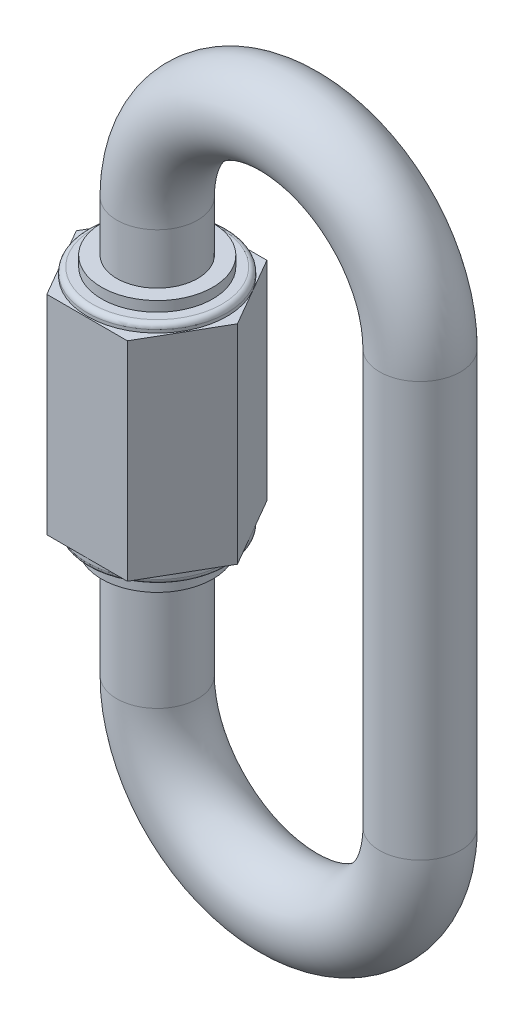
ISO-10303-21;
HEADER;
FILE_DESCRIPTION(('STEP AP214'),'2;1');
FILE_NAME('part.step','',(''),(''),'','','');
FILE_SCHEMA(('AUTOMOTIVE_DESIGN { 1 0 10303 214 1 1 1 1 }'));
ENDSEC;
DATA;
#1=APPLICATION_CONTEXT('core data for automotive mechanical design processes');
#2=APPLICATION_PROTOCOL_DEFINITION('international standard','automotive_design',2000,#1);
#3=PRODUCT_CONTEXT('',#1,'mechanical');
#4=PRODUCT('Part','Part','',(#3));
#5=PRODUCT_RELATED_PRODUCT_CATEGORY('part','',(#4));
#6=PRODUCT_DEFINITION_FORMATION('','',#4);
#7=PRODUCT_DEFINITION_CONTEXT('part definition',#1,'design');
#8=PRODUCT_DEFINITION('design','',#6,#7);
#9=PRODUCT_DEFINITION_SHAPE('','',#8);
#10=(LENGTH_UNIT() NAMED_UNIT(*) SI_UNIT(.MILLI.,.METRE.));
#11=(NAMED_UNIT(*) PLANE_ANGLE_UNIT() SI_UNIT($,.RADIAN.));
#12=(NAMED_UNIT(*) SI_UNIT($,.STERADIAN.) SOLID_ANGLE_UNIT());
#13=UNCERTAINTY_MEASURE_WITH_UNIT(LENGTH_MEASURE(1.E-05),#10,'distance_accuracy_value','');
#14=(GEOMETRIC_REPRESENTATION_CONTEXT(3) GLOBAL_UNCERTAINTY_ASSIGNED_CONTEXT((#13)) GLOBAL_UNIT_ASSIGNED_CONTEXT((#10,
#11,#12)) REPRESENTATION_CONTEXT('',''));
#15=CARTESIAN_POINT('',(0.,0.,0.));
#16=DIRECTION('',(0.,0.,1.));
#17=DIRECTION('',(1.,0.,0.));
#18=AXIS2_PLACEMENT_3D('',#15,#16,#17);
#19=CARTESIAN_POINT('',(-16.9082135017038,13.7,7.01006711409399));
#20=DIRECTION('',(0.,0.,-1.));
#21=DIRECTION('',(0.,1.,0.));
#22=AXIS2_PLACEMENT_3D('',#19,#20,#21);
#23=PLANE('',#22);
#24=DIRECTION('',(0.,1.,0.));
#25=VECTOR('',#24,1.);
#26=CARTESIAN_POINT('',(-8.94077978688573,13.7,7.01006711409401));
#27=LINE('',#26,#25);
#28=CARTESIAN_POINT('',(-8.94077978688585,-6.89999999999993,7.01006711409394));
#29=VERTEX_POINT('',#28);
#30=CARTESIAN_POINT('',(-8.94077978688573,13.7000000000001,7.010067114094));
#31=VERTEX_POINT('',#30);
#32=EDGE_CURVE('E409',#29,#31,#27,.T.);
#33=ORIENTED_EDGE('',*,*,#32,.T.);
#34=DIRECTION('',(-1.,0.,0.));
#35=VECTOR('',#34,1.);
#36=CARTESIAN_POINT('',(-24.8756472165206,13.7000000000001,7.01006711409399));
#37=LINE('',#36,#35);
#38=CARTESIAN_POINT('',(-16.9082135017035,13.7000000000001,7.01006711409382));
#39=VERTEX_POINT('',#38);
#40=EDGE_CURVE('E359',#39,#31,#37,.F.);
#41=ORIENTED_EDGE('',*,*,#40,.F.);
#42=DIRECTION('',(0.,1.,0.));
#43=VECTOR('',#42,1.);
#44=CARTESIAN_POINT('',(-16.9082135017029,13.7,7.01006711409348));
#45=LINE('',#44,#43);
#46=CARTESIAN_POINT('',(-16.9082135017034,-6.89999999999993,7.01006711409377));
#47=VERTEX_POINT('',#46);
#48=EDGE_CURVE('E423',#39,#47,#45,.F.);
#49=ORIENTED_EDGE('',*,*,#48,.T.);
#50=DIRECTION('',(-1.,0.,0.));
#51=VECTOR('',#50,1.);
#52=CARTESIAN_POINT('',(-24.8756472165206,-6.89999999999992,7.01006711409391));
#53=LINE('',#52,#51);
#54=EDGE_CURVE('E375',#47,#29,#53,.F.);
#55=ORIENTED_EDGE('',*,*,#54,.T.);
#56=EDGE_LOOP('',(#33,#41,#49,#55));
#57=FACE_BOUND('',#56,.T.);
#58=ADVANCED_FACE('F17',(#57),#23,.F.);
#59=CARTESIAN_POINT('',(-8.94077978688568,13.7,7.01006711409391));
#60=DIRECTION('',(-0.866025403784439,0.,-0.499999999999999));
#61=DIRECTION('',(-0.499999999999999,0.,0.866025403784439));
#62=AXIS2_PLACEMENT_3D('',#59,#60,#61);
#63=PLANE('',#62);
#64=DIRECTION('',(0.,1.,0.));
#65=VECTOR('',#64,1.);
#66=CARTESIAN_POINT('',(-4.95706292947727,13.7,0.110067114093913));
#67=LINE('',#66,#65);
#68=CARTESIAN_POINT('',(-4.95706292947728,-6.89999999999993,0.110067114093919));
#69=VERTEX_POINT('',#68);
#70=CARTESIAN_POINT('',(-4.95706292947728,13.7000000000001,0.110067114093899));
#71=VERTEX_POINT('',#70);
#72=EDGE_CURVE('E400',#69,#71,#67,.T.);
#73=ORIENTED_EDGE('',*,*,#72,.T.);
#74=DIRECTION('',(0.499999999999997,0.,-0.866025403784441));
#75=VECTOR('',#74,1.);
#76=CARTESIAN_POINT('',(-8.94077978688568,13.7000000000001,7.01006711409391));
#77=LINE('',#76,#75);
#78=EDGE_CURVE('E405',#31,#71,#77,.T.);
#79=ORIENTED_EDGE('',*,*,#78,.F.);
#80=ORIENTED_EDGE('',*,*,#32,.F.);
#81=DIRECTION('',(0.500000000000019,0.,-0.866025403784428));
#82=VECTOR('',#81,1.);
#83=CARTESIAN_POINT('',(-8.9407797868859,-6.89999999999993,7.01006711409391));
#84=LINE('',#83,#82);
#85=EDGE_CURVE('E428',#29,#69,#84,.T.);
#86=ORIENTED_EDGE('',*,*,#85,.T.);
#87=EDGE_LOOP('',(#73,#79,#80,#86));
#88=FACE_BOUND('',#87,.T.);
#89=ADVANCED_FACE('F447',(#88),#63,.F.);
#90=CARTESIAN_POINT('',(-4.95706292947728,13.7,0.110067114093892));
#91=DIRECTION('',(-0.866025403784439,0.,0.499999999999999));
#92=DIRECTION('',(0.499999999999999,0.,0.866025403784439));
#93=AXIS2_PLACEMENT_3D('',#90,#91,#92);
#94=PLANE('',#93);
#95=DIRECTION('',(0.,-1.,0.));
#96=VECTOR('',#95,1.);
#97=CARTESIAN_POINT('',(-8.94077978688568,13.7,-6.7899328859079));
#98=LINE('',#97,#96);
#99=CARTESIAN_POINT('',(-8.94077978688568,-6.89999999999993,-6.78993288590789));
#100=VERTEX_POINT('',#99);
#101=CARTESIAN_POINT('',(-8.94077978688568,13.7000000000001,-6.7899328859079));
#102=VERTEX_POINT('',#101);
#103=EDGE_CURVE('E396',#100,#102,#98,.F.);
#104=ORIENTED_EDGE('',*,*,#103,.T.);
#105=DIRECTION('',(-0.4999999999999,0.,-0.866025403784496));
#106=VECTOR('',#105,1.);
#107=CARTESIAN_POINT('',(-4.95706292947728,13.7,0.110067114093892));
#108=LINE('',#107,#106);
#109=EDGE_CURVE('E353',#71,#102,#108,.T.);
#110=ORIENTED_EDGE('',*,*,#109,.F.);
#111=ORIENTED_EDGE('',*,*,#72,.F.);
#112=DIRECTION('',(-0.4999999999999,0.,-0.866025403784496));
#113=VECTOR('',#112,1.);
#114=CARTESIAN_POINT('',(-4.95706292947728,-6.89999999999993,0.11006711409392));
#115=LINE('',#114,#113);
#116=EDGE_CURVE('E369',#69,#100,#115,.T.);
#117=ORIENTED_EDGE('',*,*,#116,.T.);
#118=EDGE_LOOP('',(#104,#110,#111,#117));
#119=FACE_BOUND('',#118,.T.);
#120=ADVANCED_FACE('F469',(#119),#94,.F.);
#121=CARTESIAN_POINT('',(-8.94077978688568,13.7,-6.7899328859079));
#122=DIRECTION('',(0.,0.,1.));
#123=DIRECTION('',(0.,-1.,0.));
#124=AXIS2_PLACEMENT_3D('',#121,#122,#123);
#125=PLANE('',#124);
#126=DIRECTION('',(-1.,0.,0.));
#127=VECTOR('',#126,1.);
#128=CARTESIAN_POINT('',(-12.9999999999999,-6.89999999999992,-6.7899328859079));
#129=LINE('',#128,#127);
#130=CARTESIAN_POINT('',(-14.2275224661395,-6.89999999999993,-6.7899328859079));
#131=VERTEX_POINT('',#130);
#132=CARTESIAN_POINT('',(-11.7724775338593,-6.89999999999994,-6.78993288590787));
#133=VERTEX_POINT('',#132);
#134=EDGE_CURVE('E372',#131,#133,#129,.F.);
#135=ORIENTED_EDGE('',*,*,#134,.F.);
#136=DIRECTION('',(-1.,0.,0.));
#137=VECTOR('',#136,1.);
#138=CARTESIAN_POINT('',(-24.8756472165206,-6.89999999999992,-6.7899328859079));
#139=LINE('',#138,#137);
#140=CARTESIAN_POINT('',(-16.908213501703,-6.89999999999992,-6.78993288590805));
#141=VERTEX_POINT('',#140);
#142=EDGE_CURVE('E376',#131,#141,#139,.T.);
#143=ORIENTED_EDGE('',*,*,#142,.T.);
#144=DIRECTION('',(0.,1.,0.));
#145=VECTOR('',#144,1.);
#146=CARTESIAN_POINT('',(-16.9082135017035,13.7,-6.78993288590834));
#147=LINE('',#146,#145);
#148=CARTESIAN_POINT('',(-16.9082135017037,13.7000000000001,-6.78993288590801));
#149=VERTEX_POINT('',#148);
#150=EDGE_CURVE('E392',#141,#149,#147,.T.);
#151=ORIENTED_EDGE('',*,*,#150,.T.);
#152=DIRECTION('',(-1.,0.,0.));
#153=VECTOR('',#152,1.);
#154=CARTESIAN_POINT('',(-24.8756472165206,13.7000000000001,-6.78993288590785));
#155=LINE('',#154,#153);
#156=CARTESIAN_POINT('',(-14.2275224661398,13.7,-6.78993288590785));
#157=VERTEX_POINT('',#156);
#158=EDGE_CURVE('E341',#157,#149,#155,.T.);
#159=ORIENTED_EDGE('',*,*,#158,.F.);
#160=DIRECTION('',(-1.,0.,0.));
#161=VECTOR('',#160,1.);
#162=CARTESIAN_POINT('',(-24.8756472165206,13.7000000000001,-6.78993288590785));
#163=LINE('',#162,#161);
#164=CARTESIAN_POINT('',(-11.7724775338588,13.7,-6.7899328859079));
#165=VERTEX_POINT('',#164);
#166=EDGE_CURVE('E346',#157,#165,#163,.F.);
#167=ORIENTED_EDGE('',*,*,#166,.T.);
#168=DIRECTION('',(-1.,0.,0.));
#169=VECTOR('',#168,1.);
#170=CARTESIAN_POINT('',(-24.8756472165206,13.7000000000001,-6.7899328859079));
#171=LINE('',#170,#169);
#172=EDGE_CURVE('E350',#102,#165,#171,.T.);
#173=ORIENTED_EDGE('',*,*,#172,.F.);
#174=ORIENTED_EDGE('',*,*,#103,.F.);
#175=DIRECTION('',(-1.,0.,0.));
#176=VECTOR('',#175,1.);
#177=CARTESIAN_POINT('',(-24.8756472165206,-6.89999999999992,-6.78993288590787));
#178=LINE('',#177,#176);
#179=EDGE_CURVE('E365',#100,#133,#178,.T.);
#180=ORIENTED_EDGE('',*,*,#179,.T.);
#181=EDGE_LOOP('',(#135,#143,#151,#159,#167,#173,#174,#180));
#182=FACE_BOUND('',#181,.T.);
#183=ADVANCED_FACE('F464',(#182),#125,.F.);
#184=CARTESIAN_POINT('',(-16.9082135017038,13.7,-6.7899328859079));
#185=DIRECTION('',(0.866025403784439,0.,0.499999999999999));
#186=DIRECTION('',(0.499999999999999,0.,-0.866025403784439));
#187=AXIS2_PLACEMENT_3D('',#184,#185,#186);
#188=PLANE('',#187);
#189=DIRECTION('',(0.49999999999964,0.,-0.866025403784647));
#190=VECTOR('',#189,1.);
#191=CARTESIAN_POINT('',(-19.513025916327,-6.89999999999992,-2.27826543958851));
#192=LINE('',#191,#190);
#193=CARTESIAN_POINT('',(-19.5130259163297,-6.89999999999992,-2.27826543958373));
#194=VERTEX_POINT('',#193);
#195=CARTESIAN_POINT('',(-18.2295487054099,-6.89999999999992,-4.50131317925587));
#196=VERTEX_POINT('',#195);
#197=EDGE_CURVE('E118',#194,#196,#192,.T.);
#198=ORIENTED_EDGE('',*,*,#197,.F.);
#199=DIRECTION('',(-0.500000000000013,0.,0.866025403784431));
#200=VECTOR('',#199,1.);
#201=CARTESIAN_POINT('',(-19.513025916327,-6.89999999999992,-2.27826543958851));
#202=LINE('',#201,#200);
#203=CARTESIAN_POINT('',(-20.8919303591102,-6.89999999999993,0.110067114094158));
#204=VERTEX_POINT('',#203);
#205=EDGE_CURVE('E121',#194,#204,#202,.T.);
#206=ORIENTED_EDGE('',*,*,#205,.T.);
#207=DIRECTION('',(0.,1.,0.));
#208=VECTOR('',#207,1.);
#209=CARTESIAN_POINT('',(-20.8919303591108,13.7,0.110067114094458));
#210=LINE('',#209,#208);
#211=CARTESIAN_POINT('',(-20.891930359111,13.7000000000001,0.110067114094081));
#212=VERTEX_POINT('',#211);
#213=EDGE_CURVE('E389',#204,#212,#210,.T.);
#214=ORIENTED_EDGE('',*,*,#213,.T.);
#215=DIRECTION('',(-0.499999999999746,0.,0.866025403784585));
#216=VECTOR('',#215,1.);
#217=CARTESIAN_POINT('',(-19.5130259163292,13.7000000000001,-2.2782654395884));
#218=LINE('',#217,#216);
#219=CARTESIAN_POINT('',(-19.5130259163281,13.7,-2.27826543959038));
#220=VERTEX_POINT('',#219);
#221=EDGE_CURVE('E149',#220,#212,#218,.T.);
#222=ORIENTED_EDGE('',*,*,#221,.F.);
#223=DIRECTION('',(0.500000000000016,0.,-0.866025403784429));
#224=VECTOR('',#223,1.);
#225=CARTESIAN_POINT('',(-19.5130259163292,13.7000000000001,-2.2782654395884));
#226=LINE('',#225,#224);
#227=CARTESIAN_POINT('',(-18.2295487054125,13.7,-4.50131317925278));
#228=VERTEX_POINT('',#227);
#229=EDGE_CURVE('E334',#220,#228,#226,.T.);
#230=ORIENTED_EDGE('',*,*,#229,.T.);
#231=DIRECTION('',(-0.499999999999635,0.,0.86602540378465));
#232=VECTOR('',#231,1.);
#233=CARTESIAN_POINT('',(-16.9082135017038,13.7000000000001,-6.7899328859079));
#234=LINE('',#233,#232);
#235=EDGE_CURVE('E338',#149,#228,#234,.T.);
#236=ORIENTED_EDGE('',*,*,#235,.F.);
#237=ORIENTED_EDGE('',*,*,#150,.F.);
#238=DIRECTION('',(-0.499999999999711,0.,0.866025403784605));
#239=VECTOR('',#238,1.);
#240=CARTESIAN_POINT('',(-16.9082135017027,-6.89999999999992,-6.78993288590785));
#241=LINE('',#240,#239);
#242=EDGE_CURVE('E115',#141,#196,#241,.T.);
#243=ORIENTED_EDGE('',*,*,#242,.T.);
#244=EDGE_LOOP('',(#198,#206,#214,#222,#230,#236,#237,#243));
#245=FACE_BOUND('',#244,.T.);
#246=ADVANCED_FACE('F120',(#245),#188,.F.);
#247=CARTESIAN_POINT('',(-20.8919303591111,13.7,0.110067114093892));
#248=DIRECTION('',(0.866025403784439,0.,-0.499999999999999));
#249=DIRECTION('',(-0.499999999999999,0.,-0.866025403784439));
#250=AXIS2_PLACEMENT_3D('',#247,#248,#249);
#251=PLANE('',#250);
#252=CARTESIAN_POINT('',(-12.9999999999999,-6.89999999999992,0.));
#253=DIRECTION('',(0.,-1.,0.));
#254=DIRECTION('',(-0.83734433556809,0.,0.546675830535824));
#255=AXIS2_PLACEMENT_3D('',#252,#253,#254);
#256=CIRCLE('',#255,6.9);
#257=CARTESIAN_POINT('',(-18.777675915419,-6.89999999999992,3.77206323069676));
#258=VERTEX_POINT('',#257);
#259=CARTESIAN_POINT('',(-19.1555405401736,-6.89999999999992,3.11758250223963));
#260=VERTEX_POINT('',#259);
#261=EDGE_CURVE('E145',#258,#260,#256,.T.);
#262=ORIENTED_EDGE('',*,*,#261,.F.);
#263=DIRECTION('',(0.499999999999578,0.,0.866025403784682));
#264=VECTOR('',#263,1.);
#265=CARTESIAN_POINT('',(-18.7776759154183,-6.89999999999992,3.77206323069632));
#266=LINE('',#265,#264);
#267=EDGE_CURVE('E360',#258,#47,#266,.T.);
#268=ORIENTED_EDGE('',*,*,#267,.T.);
#269=ORIENTED_EDGE('',*,*,#48,.F.);
#270=DIRECTION('',(0.499999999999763,0.,0.866025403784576));
#271=VECTOR('',#270,1.);
#272=CARTESIAN_POINT('',(-18.7776759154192,13.7000000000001,3.77206323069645));
#273=LINE('',#272,#271);
#274=CARTESIAN_POINT('',(-18.7776759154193,13.7,3.77206323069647));
#275=VERTEX_POINT('',#274);
#276=EDGE_CURVE('E356',#275,#39,#273,.T.);
#277=ORIENTED_EDGE('',*,*,#276,.F.);
#278=CARTESIAN_POINT('',(-12.999999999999,13.7,0.));
#279=DIRECTION('',(0.,1.,0.));
#280=DIRECTION('',(-0.892107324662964,0.,0.451823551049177));
#281=AXIS2_PLACEMENT_3D('',#278,#279,#280);
#282=CIRCLE('',#281,6.9);
#283=CARTESIAN_POINT('',(-19.1555405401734,13.7,3.11758250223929));
#284=VERTEX_POINT('',#283);
#285=EDGE_CURVE('E391',#284,#275,#282,.T.);
#286=ORIENTED_EDGE('',*,*,#285,.F.);
#287=DIRECTION('',(0.50000000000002,0.,0.866025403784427));
#288=VECTOR('',#287,1.);
#289=CARTESIAN_POINT('',(-20.8919303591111,13.7000000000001,0.110067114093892));
#290=LINE('',#289,#288);
#291=EDGE_CURVE('E147',#212,#284,#290,.T.);
#292=ORIENTED_EDGE('',*,*,#291,.F.);
#293=ORIENTED_EDGE('',*,*,#213,.F.);
#294=DIRECTION('',(0.499999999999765,0.,0.866025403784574));
#295=VECTOR('',#294,1.);
#296=CARTESIAN_POINT('',(-20.89193035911,-6.89999999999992,0.110067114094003));
#297=LINE('',#296,#295);
#298=EDGE_CURVE('E133',#204,#260,#297,.T.);
#299=ORIENTED_EDGE('',*,*,#298,.T.);
#300=EDGE_LOOP('',(#262,#268,#269,#277,#286,#292,#293,#299));
#301=FACE_BOUND('',#300,.T.);
#302=ADVANCED_FACE('F221',(#301),#251,.F.);
#303=CARTESIAN_POINT('',(-24.8756472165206,-6.89999999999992,7.01006711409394));
#304=DIRECTION('',(0.,1.,0.));
#305=DIRECTION('',(-1.,0.,0.));
#306=AXIS2_PLACEMENT_3D('',#303,#304,#305);
#307=PLANE('',#306);
#308=CARTESIAN_POINT('',(-12.9999999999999,-6.89999999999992,0.));
#309=DIRECTION('',(0.,-1.,0.));
#310=DIRECTION('',(1.,0.,0.));
#311=AXIS2_PLACEMENT_3D('',#308,#309,#310);
#312=CIRCLE('',#311,6.9);
#313=EDGE_CURVE('E130',#260,#194,#312,.T.);
#314=ORIENTED_EDGE('',*,*,#313,.F.);
#315=ORIENTED_EDGE('',*,*,#298,.F.);
#316=ORIENTED_EDGE('',*,*,#205,.F.);
#317=EDGE_LOOP('',(#314,#315,#316));
#318=FACE_BOUND('',#317,.T.);
#319=ADVANCED_FACE('F128',(#318),#307,.F.);
#320=CARTESIAN_POINT('',(-12.9999999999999,-6.89999999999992,0.));
#321=DIRECTION('',(0.,1.,0.));
#322=DIRECTION('',(-1.,0.,0.));
#323=AXIS2_PLACEMENT_3D('',#320,#321,#322);
#324=PLANE('',#323);
#325=ORIENTED_EDGE('',*,*,#197,.T.);
#326=CARTESIAN_POINT('',(-12.9999999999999,-6.89999999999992,0.));
#327=DIRECTION('',(0.,-1.,0.));
#328=DIRECTION('',(1.,0.,0.));
#329=AXIS2_PLACEMENT_3D('',#326,#327,#328);
#330=CIRCLE('',#329,6.9);
#331=EDGE_CURVE('E136',#194,#196,#330,.T.);
#332=ORIENTED_EDGE('',*,*,#331,.F.);
#333=EDGE_LOOP('',(#325,#332));
#334=FACE_BOUND('',#333,.T.);
#335=ADVANCED_FACE('F137',(#334),#324,.T.);
#336=CARTESIAN_POINT('',(-24.8756472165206,-6.89999999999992,7.01006711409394));
#337=DIRECTION('',(0.,1.,0.));
#338=DIRECTION('',(-1.,0.,0.));
#339=AXIS2_PLACEMENT_3D('',#336,#337,#338);
#340=PLANE('',#339);
#341=CARTESIAN_POINT('',(-12.9999999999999,-6.89999999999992,0.));
#342=DIRECTION('',(0.,-1.,0.));
#343=DIRECTION('',(1.,0.,0.));
#344=AXIS2_PLACEMENT_3D('',#341,#342,#343);
#345=CIRCLE('',#344,6.9);
#346=EDGE_CURVE('E140',#196,#131,#345,.T.);
#347=ORIENTED_EDGE('',*,*,#346,.F.);
#348=ORIENTED_EDGE('',*,*,#242,.F.);
#349=ORIENTED_EDGE('',*,*,#142,.F.);
#350=EDGE_LOOP('',(#347,#348,#349));
#351=FACE_BOUND('',#350,.T.);
#352=ADVANCED_FACE('F212',(#351),#340,.F.);
#353=CARTESIAN_POINT('',(-12.9999999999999,-6.89999999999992,0.));
#354=DIRECTION('',(0.,1.,0.));
#355=DIRECTION('',(-1.,0.,0.));
#356=AXIS2_PLACEMENT_3D('',#353,#354,#355);
#357=PLANE('',#356);
#358=ORIENTED_EDGE('',*,*,#134,.T.);
#359=CARTESIAN_POINT('',(-12.9999999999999,-6.89999999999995,0.));
#360=DIRECTION('',(0.,-1.,0.));
#361=DIRECTION('',(1.,0.,0.));
#362=AXIS2_PLACEMENT_3D('',#359,#360,#361);
#363=CIRCLE('',#362,6.9);
#364=EDGE_CURVE('E157',#131,#133,#363,.T.);
#365=ORIENTED_EDGE('',*,*,#364,.F.);
#366=EDGE_LOOP('',(#358,#365));
#367=FACE_BOUND('',#366,.T.);
#368=ADVANCED_FACE('F208',(#367),#357,.T.);
#369=CARTESIAN_POINT('',(-24.8756472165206,-6.89999999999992,7.01006711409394));
#370=DIRECTION('',(0.,1.,0.));
#371=DIRECTION('',(-1.,0.,0.));
#372=AXIS2_PLACEMENT_3D('',#369,#370,#371);
#373=PLANE('',#372);
#374=ORIENTED_EDGE('',*,*,#267,.F.);
#375=CARTESIAN_POINT('',(-12.9999999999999,-6.89999999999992,0.));
#376=DIRECTION('',(0.,-1.,0.));
#377=DIRECTION('',(1.,0.,0.));
#378=AXIS2_PLACEMENT_3D('',#375,#376,#377);
#379=CIRCLE('',#378,6.9);
#380=EDGE_CURVE('E154',#133,#258,#379,.T.);
#381=ORIENTED_EDGE('',*,*,#380,.F.);
#382=ORIENTED_EDGE('',*,*,#179,.F.);
#383=ORIENTED_EDGE('',*,*,#116,.F.);
#384=ORIENTED_EDGE('',*,*,#85,.F.);
#385=ORIENTED_EDGE('',*,*,#54,.F.);
#386=EDGE_LOOP('',(#374,#381,#382,#383,#384,#385));
#387=FACE_BOUND('',#386,.T.);
#388=ADVANCED_FACE('F204',(#387),#373,.F.);
#389=CARTESIAN_POINT('',(-24.8756472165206,13.7000000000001,7.01006711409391));
#390=DIRECTION('',(0.,1.,0.));
#391=DIRECTION('',(-1.,0.,0.));
#392=AXIS2_PLACEMENT_3D('',#389,#390,#391);
#393=PLANE('',#392);
#394=ORIENTED_EDGE('',*,*,#172,.T.);
#395=CARTESIAN_POINT('',(-12.999999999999,13.7,0.));
#396=DIRECTION('',(0.,1.,0.));
#397=DIRECTION('',(-1.,0.,0.));
#398=AXIS2_PLACEMENT_3D('',#395,#396,#397);
#399=CIRCLE('',#398,6.9);
#400=EDGE_CURVE('E156',#275,#165,#399,.T.);
#401=ORIENTED_EDGE('',*,*,#400,.F.);
#402=ORIENTED_EDGE('',*,*,#276,.T.);
#403=ORIENTED_EDGE('',*,*,#40,.T.);
#404=ORIENTED_EDGE('',*,*,#78,.T.);
#405=ORIENTED_EDGE('',*,*,#109,.T.);
#406=EDGE_LOOP('',(#394,#401,#402,#403,#404,#405));
#407=FACE_BOUND('',#406,.T.);
#408=ADVANCED_FACE('F200',(#407),#393,.T.);
#409=CARTESIAN_POINT('',(-24.8756472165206,13.7000000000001,7.01006711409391));
#410=DIRECTION('',(0.,1.,0.));
#411=DIRECTION('',(-1.,0.,0.));
#412=AXIS2_PLACEMENT_3D('',#409,#410,#411);
#413=PLANE('',#412);
#414=ORIENTED_EDGE('',*,*,#166,.F.);
#415=CARTESIAN_POINT('',(-12.999999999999,13.7,0.));
#416=DIRECTION('',(0.,1.,0.));
#417=DIRECTION('',(-1.,0.,0.));
#418=AXIS2_PLACEMENT_3D('',#415,#416,#417);
#419=CIRCLE('',#418,6.9);
#420=EDGE_CURVE('E162',#165,#157,#419,.T.);
#421=ORIENTED_EDGE('',*,*,#420,.F.);
#422=EDGE_LOOP('',(#414,#421));
#423=FACE_BOUND('',#422,.T.);
#424=ADVANCED_FACE('F196',(#423),#413,.F.);
#425=CARTESIAN_POINT('',(-24.8756472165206,13.7000000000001,7.01006711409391));
#426=DIRECTION('',(0.,1.,0.));
#427=DIRECTION('',(-1.,0.,0.));
#428=AXIS2_PLACEMENT_3D('',#425,#426,#427);
#429=PLANE('',#428);
#430=ORIENTED_EDGE('',*,*,#158,.T.);
#431=ORIENTED_EDGE('',*,*,#235,.T.);
#432=CARTESIAN_POINT('',(-12.999999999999,13.7,0.));
#433=DIRECTION('',(0.,1.,0.));
#434=DIRECTION('',(-1.,0.,0.));
#435=AXIS2_PLACEMENT_3D('',#432,#433,#434);
#436=CIRCLE('',#435,6.9);
#437=EDGE_CURVE('E265',#157,#228,#436,.T.);
#438=ORIENTED_EDGE('',*,*,#437,.F.);
#439=EDGE_LOOP('',(#430,#431,#438));
#440=FACE_BOUND('',#439,.T.);
#441=ADVANCED_FACE('F192',(#440),#429,.T.);
#442=CARTESIAN_POINT('',(-24.8756472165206,13.7000000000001,7.01006711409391));
#443=DIRECTION('',(0.,1.,0.));
#444=DIRECTION('',(-1.,0.,0.));
#445=AXIS2_PLACEMENT_3D('',#442,#443,#444);
#446=PLANE('',#445);
#447=ORIENTED_EDGE('',*,*,#229,.F.);
#448=CARTESIAN_POINT('',(-12.999999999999,13.7000000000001,0.));
#449=DIRECTION('',(0.,1.,0.));
#450=DIRECTION('',(-1.,0.,0.));
#451=AXIS2_PLACEMENT_3D('',#448,#449,#450);
#452=CIRCLE('',#451,6.9);
#453=EDGE_CURVE('E168',#228,#220,#452,.T.);
#454=ORIENTED_EDGE('',*,*,#453,.F.);
#455=EDGE_LOOP('',(#447,#454));
#456=FACE_BOUND('',#455,.T.);
#457=ADVANCED_FACE('F188',(#456),#446,.F.);
#458=CARTESIAN_POINT('',(-24.8756472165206,13.7000000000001,7.01006711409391));
#459=DIRECTION('',(0.,1.,0.));
#460=DIRECTION('',(-1.,0.,0.));
#461=AXIS2_PLACEMENT_3D('',#458,#459,#460);
#462=PLANE('',#461);
#463=ORIENTED_EDGE('',*,*,#291,.T.);
#464=CARTESIAN_POINT('',(-12.999999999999,13.7,0.));
#465=DIRECTION('',(0.,1.,0.));
#466=DIRECTION('',(-1.,0.,0.));
#467=AXIS2_PLACEMENT_3D('',#464,#465,#466);
#468=CIRCLE('',#467,6.9);
#469=EDGE_CURVE('E165',#220,#284,#468,.T.);
#470=ORIENTED_EDGE('',*,*,#469,.F.);
#471=ORIENTED_EDGE('',*,*,#221,.T.);
#472=EDGE_LOOP('',(#463,#470,#471));
#473=FACE_BOUND('',#472,.T.);
#474=ADVANCED_FACE('F183',(#473),#462,.T.);
#475=CARTESIAN_POINT('',(-12.9999999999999,-6.89999999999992,0.));
#476=DIRECTION('',(0.,-1.,0.));
#477=DIRECTION('',(1.,0.,0.));
#478=AXIS2_PLACEMENT_3D('',#475,#476,#477);
#479=CYLINDRICAL_SURFACE('',#478,6.9);
#480=ORIENTED_EDGE('',*,*,#261,.T.);
#481=ORIENTED_EDGE('',*,*,#313,.T.);
#482=ORIENTED_EDGE('',*,*,#331,.T.);
#483=ORIENTED_EDGE('',*,*,#346,.T.);
#484=ORIENTED_EDGE('',*,*,#364,.T.);
#485=ORIENTED_EDGE('',*,*,#380,.T.);
#486=EDGE_LOOP('',(#480,#481,#482,#483,#484,#485));
#487=FACE_BOUND('',#486,.T.);
#488=CARTESIAN_POINT('',(-12.9999999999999,-7.40000000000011,1.11022302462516E-13));
#489=DIRECTION('',(0.,1.,0.));
#490=DIRECTION('',(-1.,0.,0.));
#491=AXIS2_PLACEMENT_3D('',#488,#489,#490);
#492=CIRCLE('',#491,6.9);
#493=CARTESIAN_POINT('',(-19.8999999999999,-7.40000000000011,1.11022302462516E-13));
#494=VERTEX_POINT('',#493);
#495=EDGE_CURVE('E167',#494,#494,#492,.F.);
#496=ORIENTED_EDGE('',*,*,#495,.F.);
#497=EDGE_LOOP('',(#496));
#498=FACE_BOUND('',#497,.T.);
#499=ADVANCED_FACE('F142',(#487,#498),#479,.T.);
#500=CARTESIAN_POINT('',(-12.999999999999,-5.81614716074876,0.));
#501=DIRECTION('',(0.,1.,0.));
#502=DIRECTION('',(-1.,0.,0.));
#503=AXIS2_PLACEMENT_3D('',#500,#501,#502);
#504=CYLINDRICAL_SURFACE('',#503,6.9);
#505=ORIENTED_EDGE('',*,*,#285,.T.);
#506=ORIENTED_EDGE('',*,*,#400,.T.);
#507=ORIENTED_EDGE('',*,*,#420,.T.);
#508=ORIENTED_EDGE('',*,*,#437,.T.);
#509=ORIENTED_EDGE('',*,*,#453,.T.);
#510=ORIENTED_EDGE('',*,*,#469,.T.);
#511=EDGE_LOOP('',(#505,#506,#507,#508,#509,#510));
#512=FACE_BOUND('',#511,.T.);
#513=CARTESIAN_POINT('',(-12.9999999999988,14.,0.));
#514=DIRECTION('',(0.,-1.,0.));
#515=DIRECTION('',(1.,0.,0.));
#516=AXIS2_PLACEMENT_3D('',#513,#514,#515);
#517=CIRCLE('',#516,6.9);
#518=CARTESIAN_POINT('',(-6.09999999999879,14.,0.));
#519=VERTEX_POINT('',#518);
#520=EDGE_CURVE('E319',#519,#519,#517,.F.);
#521=ORIENTED_EDGE('',*,*,#520,.F.);
#522=EDGE_LOOP('',(#521));
#523=FACE_BOUND('',#522,.T.);
#524=ADVANCED_FACE('F182',(#512,#523),#504,.T.);
#525=CARTESIAN_POINT('',(-12.9999999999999,-7.40000000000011,1.11022302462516E-13));
#526=DIRECTION('',(0.,1.,0.));
#527=DIRECTION('',(-1.,0.,0.));
#528=AXIS2_PLACEMENT_3D('',#525,#526,#527);
#529=TOROIDAL_SURFACE('',#528,6.4,0.5);
#530=CARTESIAN_POINT('',(-12.9999999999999,-7.90000000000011,1.11022302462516E-13));
#531=DIRECTION('',(0.,1.,0.));
#532=DIRECTION('',(-1.,0.,0.));
#533=AXIS2_PLACEMENT_3D('',#530,#531,#532);
#534=CIRCLE('',#533,6.39999999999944);
#535=CARTESIAN_POINT('',(-19.3999999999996,-7.90000000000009,0.));
#536=VERTEX_POINT('',#535);
#537=CARTESIAN_POINT('',(-6.59999999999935,-7.9000000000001,0.));
#538=VERTEX_POINT('',#537);
#539=EDGE_CURVE('E327',#536,#538,#534,.T.);
#540=ORIENTED_EDGE('',*,*,#539,.T.);
#541=CARTESIAN_POINT('',(-12.9999999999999,-7.90000000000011,1.11022302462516E-13));
#542=DIRECTION('',(0.,1.,0.));
#543=DIRECTION('',(1.,0.,0.));
#544=AXIS2_PLACEMENT_3D('',#541,#542,#543);
#545=CIRCLE('',#544,6.40000000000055);
#546=EDGE_CURVE('E314',#538,#536,#545,.T.);
#547=ORIENTED_EDGE('',*,*,#546,.T.);
#548=EDGE_LOOP('',(#540,#547));
#549=FACE_BOUND('',#548,.T.);
#550=ORIENTED_EDGE('',*,*,#495,.T.);
#551=EDGE_LOOP('',(#550));
#552=FACE_BOUND('',#551,.T.);
#553=ADVANCED_FACE('F289',(#549,#552),#529,.T.);
#554=CARTESIAN_POINT('',(-12.9999999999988,14.,0.));
#555=DIRECTION('',(0.,-1.,0.));
#556=DIRECTION('',(1.,0.,0.));
#557=AXIS2_PLACEMENT_3D('',#554,#555,#556);
#558=TOROIDAL_SURFACE('',#557,6.4,0.5);
#559=CARTESIAN_POINT('',(-12.9999999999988,14.5,0.));
#560=DIRECTION('',(0.,-1.,0.));
#561=DIRECTION('',(1.,0.,0.));
#562=AXIS2_PLACEMENT_3D('',#559,#560,#561);
#563=CIRCLE('',#562,6.4);
#564=CARTESIAN_POINT('',(-6.59999999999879,14.5,0.));
#565=VERTEX_POINT('',#564);
#566=CARTESIAN_POINT('',(-19.3999999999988,14.5,0.));
#567=VERTEX_POINT('',#566);
#568=EDGE_CURVE('E34',#565,#567,#563,.T.);
#569=ORIENTED_EDGE('',*,*,#568,.T.);
#570=CARTESIAN_POINT('',(-12.9999999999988,14.5,0.));
#571=DIRECTION('',(0.,-1.,0.));
#572=DIRECTION('',(-1.,0.,0.));
#573=AXIS2_PLACEMENT_3D('',#570,#571,#572);
#574=CIRCLE('',#573,6.4);
#575=EDGE_CURVE('E262',#567,#565,#574,.T.);
#576=ORIENTED_EDGE('',*,*,#575,.T.);
#577=EDGE_LOOP('',(#569,#576));
#578=FACE_BOUND('',#577,.T.);
#579=ORIENTED_EDGE('',*,*,#520,.T.);
#580=EDGE_LOOP('',(#579));
#581=FACE_BOUND('',#580,.T.);
#582=ADVANCED_FACE('F278',(#578,#581),#558,.T.);
#583=CARTESIAN_POINT('',(-12.9999999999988,-7.90000000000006,0.));
#584=DIRECTION('',(0.,1.,0.));
#585=DIRECTION('',(-1.,0.,0.));
#586=AXIS2_PLACEMENT_3D('',#583,#584,#585);
#587=PLANE('',#586);
#588=CARTESIAN_POINT('',(-12.9999999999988,-7.90000000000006,0.));
#589=DIRECTION('',(0.,-1.,0.));
#590=DIRECTION('',(1.,0.,0.));
#591=AXIS2_PLACEMENT_3D('',#588,#589,#590);
#592=CIRCLE('',#591,5.5);
#593=CARTESIAN_POINT('',(-7.49999999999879,-7.90000000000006,0.));
#594=VERTEX_POINT('',#593);
#595=EDGE_CURVE('E259',#594,#594,#592,.T.);
#596=ORIENTED_EDGE('',*,*,#595,.F.);
#597=EDGE_LOOP('',(#596));
#598=FACE_BOUND('',#597,.T.);
#599=ORIENTED_EDGE('',*,*,#539,.F.);
#600=ORIENTED_EDGE('',*,*,#546,.F.);
#601=EDGE_LOOP('',(#599,#600));
#602=FACE_BOUND('',#601,.T.);
#603=ADVANCED_FACE('F288',(#598,#602),#587,.F.);
#604=CARTESIAN_POINT('',(-12.9999999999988,14.5,0.));
#605=DIRECTION('',(0.,-1.,0.));
#606=DIRECTION('',(1.,0.,0.));
#607=AXIS2_PLACEMENT_3D('',#604,#605,#606);
#608=PLANE('',#607);
#609=CARTESIAN_POINT('',(-12.9999999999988,14.5,0.));
#610=DIRECTION('',(0.,1.,0.));
#611=DIRECTION('',(-1.,0.,0.));
#612=AXIS2_PLACEMENT_3D('',#609,#610,#611);
#613=CIRCLE('',#612,5.5);
#614=CARTESIAN_POINT('',(-18.4999999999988,14.5,0.));
#615=VERTEX_POINT('',#614);
#616=EDGE_CURVE('E256',#615,#615,#613,.T.);
#617=ORIENTED_EDGE('',*,*,#616,.F.);
#618=EDGE_LOOP('',(#617));
#619=FACE_BOUND('',#618,.T.);
#620=ORIENTED_EDGE('',*,*,#568,.F.);
#621=ORIENTED_EDGE('',*,*,#575,.F.);
#622=EDGE_LOOP('',(#620,#621));
#623=FACE_BOUND('',#622,.T.);
#624=ADVANCED_FACE('F510',(#619,#623),#608,.F.);
#625=CARTESIAN_POINT('',(-12.9999999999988,-7.90000000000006,0.));
#626=DIRECTION('',(0.,-1.,0.));
#627=DIRECTION('',(1.,0.,0.));
#628=AXIS2_PLACEMENT_3D('',#625,#626,#627);
#629=CYLINDRICAL_SURFACE('',#628,5.5);
#630=ORIENTED_EDGE('',*,*,#595,.T.);
#631=EDGE_LOOP('',(#630));
#632=FACE_BOUND('',#631,.T.);
#633=CARTESIAN_POINT('',(-12.9999999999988,-9.50000000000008,0.));
#634=DIRECTION('',(0.,-1.,0.));
#635=DIRECTION('',(1.,0.,0.));
#636=AXIS2_PLACEMENT_3D('',#633,#634,#635);
#637=CIRCLE('',#636,5.5);
#638=CARTESIAN_POINT('',(-7.49999999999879,-9.50000000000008,0.));
#639=VERTEX_POINT('',#638);
#640=EDGE_CURVE('E253',#639,#639,#637,.F.);
#641=ORIENTED_EDGE('',*,*,#640,.T.);
#642=EDGE_LOOP('',(#641));
#643=FACE_BOUND('',#642,.T.);
#644=ADVANCED_FACE('F519',(#632,#643),#629,.T.);
#645=CARTESIAN_POINT('',(-12.9999999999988,14.5,0.));
#646=DIRECTION('',(0.,1.,0.));
#647=DIRECTION('',(-1.,0.,0.));
#648=AXIS2_PLACEMENT_3D('',#645,#646,#647);
#649=CYLINDRICAL_SURFACE('',#648,5.5);
#650=ORIENTED_EDGE('',*,*,#616,.T.);
#651=EDGE_LOOP('',(#650));
#652=FACE_BOUND('',#651,.T.);
#653=CARTESIAN_POINT('',(-12.9999999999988,15.5,0.));
#654=DIRECTION('',(0.,1.,0.));
#655=DIRECTION('',(-1.,0.,0.));
#656=AXIS2_PLACEMENT_3D('',#653,#654,#655);
#657=CIRCLE('',#656,5.5);
#658=CARTESIAN_POINT('',(-18.4999999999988,15.5,0.));
#659=VERTEX_POINT('',#658);
#660=EDGE_CURVE('E250',#659,#659,#657,.F.);
#661=ORIENTED_EDGE('',*,*,#660,.T.);
#662=EDGE_LOOP('',(#661));
#663=FACE_BOUND('',#662,.T.);
#664=ADVANCED_FACE('F644',(#652,#663),#649,.T.);
#665=CARTESIAN_POINT('',(-12.9999999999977,-9.50000000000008,0.));
#666=DIRECTION('',(0.,1.,0.));
#667=DIRECTION('',(-1.,0.,0.));
#668=AXIS2_PLACEMENT_3D('',#665,#666,#667);
#669=PLANE('',#668);
#670=CARTESIAN_POINT('',(-12.9999999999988,-9.50000000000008,0.));
#671=DIRECTION('',(0.,1.,0.));
#672=DIRECTION('',(-1.,0.,0.));
#673=AXIS2_PLACEMENT_3D('',#670,#671,#672);
#674=CIRCLE('',#673,4.);
#675=CARTESIAN_POINT('',(-16.9999999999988,-9.50000000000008,0.));
#676=VERTEX_POINT('',#675);
#677=EDGE_CURVE('E247',#676,#676,#674,.F.);
#678=ORIENTED_EDGE('',*,*,#677,.F.);
#679=EDGE_LOOP('',(#678));
#680=FACE_BOUND('',#679,.T.);
#681=ORIENTED_EDGE('',*,*,#640,.F.);
#682=EDGE_LOOP('',(#681));
#683=FACE_BOUND('',#682,.T.);
#684=ADVANCED_FACE('F651',(#680,#683),#669,.F.);
#685=CARTESIAN_POINT('',(-12.9999999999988,15.5,0.));
#686=DIRECTION('',(0.,-1.,0.));
#687=DIRECTION('',(1.,0.,0.));
#688=AXIS2_PLACEMENT_3D('',#685,#686,#687);
#689=PLANE('',#688);
#690=ORIENTED_EDGE('',*,*,#660,.F.);
#691=EDGE_LOOP('',(#690));
#692=FACE_BOUND('',#691,.T.);
#693=CARTESIAN_POINT('',(-12.9999999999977,15.5,0.));
#694=DIRECTION('',(0.,-1.,0.));
#695=DIRECTION('',(0.,0.,-1.));
#696=AXIS2_PLACEMENT_3D('',#693,#694,#695);
#697=CIRCLE('',#696,4.00000000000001);
#698=CARTESIAN_POINT('',(-12.9999999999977,15.5,-3.99999999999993));
#699=VERTEX_POINT('',#698);
#700=EDGE_CURVE('E238',#699,#699,#697,.F.);
#701=ORIENTED_EDGE('',*,*,#700,.F.);
#702=EDGE_LOOP('',(#701));
#703=FACE_BOUND('',#702,.T.);
#704=ADVANCED_FACE('F658',(#692,#703),#689,.F.);
#705=CARTESIAN_POINT('',(-12.9999999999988,-20.5,0.));
#706=DIRECTION('',(0.,1.,0.));
#707=DIRECTION('',(-1.,0.,0.));
#708=AXIS2_PLACEMENT_3D('',#705,#706,#707);
#709=CYLINDRICAL_SURFACE('',#708,4.);
#710=CARTESIAN_POINT('',(-12.9999999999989,-20.5,0.));
#711=DIRECTION('',(0.,-1.,0.));
#712=DIRECTION('',(-1.,0.,0.));
#713=AXIS2_PLACEMENT_3D('',#710,#711,#712);
#714=CIRCLE('',#713,4.);
#715=CARTESIAN_POINT('',(-16.9999999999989,-20.5,0.));
#716=VERTEX_POINT('',#715);
#717=EDGE_CURVE('E246',#716,#716,#714,.T.);
#718=ORIENTED_EDGE('',*,*,#717,.F.);
#719=EDGE_LOOP('',(#718));
#720=FACE_BOUND('',#719,.T.);
#721=ORIENTED_EDGE('',*,*,#677,.T.);
#722=EDGE_LOOP('',(#721));
#723=FACE_BOUND('',#722,.T.);
#724=ADVANCED_FACE('F666',(#720,#723),#709,.T.);
#725=CARTESIAN_POINT('',(-12.9999999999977,20.5,0.));
#726=DIRECTION('',(0.,-1.,0.));
#727=DIRECTION('',(0.,0.,-1.));
#728=AXIS2_PLACEMENT_3D('',#725,#726,#727);
#729=CYLINDRICAL_SURFACE('',#728,4.00000000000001);
#730=CARTESIAN_POINT('',(-12.9999999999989,20.5,0.));
#731=DIRECTION('',(0.,-1.,0.));
#732=DIRECTION('',(-1.,0.,0.));
#733=AXIS2_PLACEMENT_3D('',#730,#731,#732);
#734=CIRCLE('',#733,4.);
#735=CARTESIAN_POINT('',(-16.9999999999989,20.5,0.));
#736=VERTEX_POINT('',#735);
#737=EDGE_CURVE('E499',#736,#736,#734,.F.);
#738=ORIENTED_EDGE('',*,*,#737,.F.);
#739=EDGE_LOOP('',(#738));
#740=FACE_BOUND('',#739,.T.);
#741=ORIENTED_EDGE('',*,*,#700,.T.);
#742=EDGE_LOOP('',(#741));
#743=FACE_BOUND('',#742,.T.);
#744=ADVANCED_FACE('F674',(#740,#743),#729,.T.);
#745=CARTESIAN_POINT('',(1.11022302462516E-12,-20.5,0.));
#746=DIRECTION('',(0.,0.,1.));
#747=DIRECTION('',(1.,0.,0.));
#748=AXIS2_PLACEMENT_3D('',#745,#746,#747);
#749=TOROIDAL_SURFACE('',#748,13.,4.);
#750=ORIENTED_EDGE('',*,*,#717,.T.);
#751=EDGE_LOOP('',(#750));
#752=FACE_BOUND('',#751,.T.);
#753=CARTESIAN_POINT('',(13.000000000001,-20.5,0.));
#754=DIRECTION('',(0.,1.,0.));
#755=DIRECTION('',(-1.,0.,0.));
#756=AXIS2_PLACEMENT_3D('',#753,#754,#755);
#757=CIRCLE('',#756,4.);
#758=CARTESIAN_POINT('',(9.00000000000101,-20.5,0.));
#759=VERTEX_POINT('',#758);
#760=EDGE_CURVE('E26',#759,#759,#757,.T.);
#761=ORIENTED_EDGE('',*,*,#760,.F.);
#762=EDGE_LOOP('',(#761));
#763=FACE_BOUND('',#762,.T.);
#764=ADVANCED_FACE('F486',(#752,#763),#749,.T.);
#765=CARTESIAN_POINT('',(1.11022302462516E-12,20.5,0.));
#766=DIRECTION('',(0.,0.,1.));
#767=DIRECTION('',(1.,0.,0.));
#768=AXIS2_PLACEMENT_3D('',#765,#766,#767);
#769=TOROIDAL_SURFACE('',#768,13.,4.);
#770=CARTESIAN_POINT('',(13.000000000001,20.5,0.));
#771=DIRECTION('',(0.,1.,0.));
#772=DIRECTION('',(-1.,0.,0.));
#773=AXIS2_PLACEMENT_3D('',#770,#771,#772);
#774=CIRCLE('',#773,4.);
#775=CARTESIAN_POINT('',(9.00000000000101,20.5,0.));
#776=VERTEX_POINT('',#775);
#777=EDGE_CURVE('E11',#776,#776,#774,.F.);
#778=ORIENTED_EDGE('',*,*,#777,.F.);
#779=EDGE_LOOP('',(#778));
#780=FACE_BOUND('',#779,.T.);
#781=ORIENTED_EDGE('',*,*,#737,.T.);
#782=EDGE_LOOP('',(#781));
#783=FACE_BOUND('',#782,.T.);
#784=ADVANCED_FACE('F480',(#780,#783),#769,.T.);
#785=CARTESIAN_POINT('',(13.000000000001,-20.5,0.));
#786=DIRECTION('',(0.,1.,0.));
#787=DIRECTION('',(-1.,0.,0.));
#788=AXIS2_PLACEMENT_3D('',#785,#786,#787);
#789=CYLINDRICAL_SURFACE('',#788,4.);
#790=ORIENTED_EDGE('',*,*,#760,.T.);
#791=EDGE_LOOP('',(#790));
#792=FACE_BOUND('',#791,.T.);
#793=ORIENTED_EDGE('',*,*,#777,.T.);
#794=EDGE_LOOP('',(#793));
#795=FACE_BOUND('',#794,.T.);
#796=ADVANCED_FACE('F478',(#792,#795),#789,.T.);
#797=CLOSED_SHELL('',(#58,#89,#120,#183,#246,#302,#319,#335,#352,#368,#388,#408,#424,#441,#457,
#474,#499,#524,#553,#582,#603,#624,#644,#664,#684,#704,#724,#744,#764,#784,#796));
#798=MANIFOLD_SOLID_BREP('B1',#797);
#799=ADVANCED_BREP_SHAPE_REPRESENTATION('',(#18,#798),#14);
#800=SHAPE_DEFINITION_REPRESENTATION(#9,#799);
ENDSEC;
END-ISO-10303-21;
